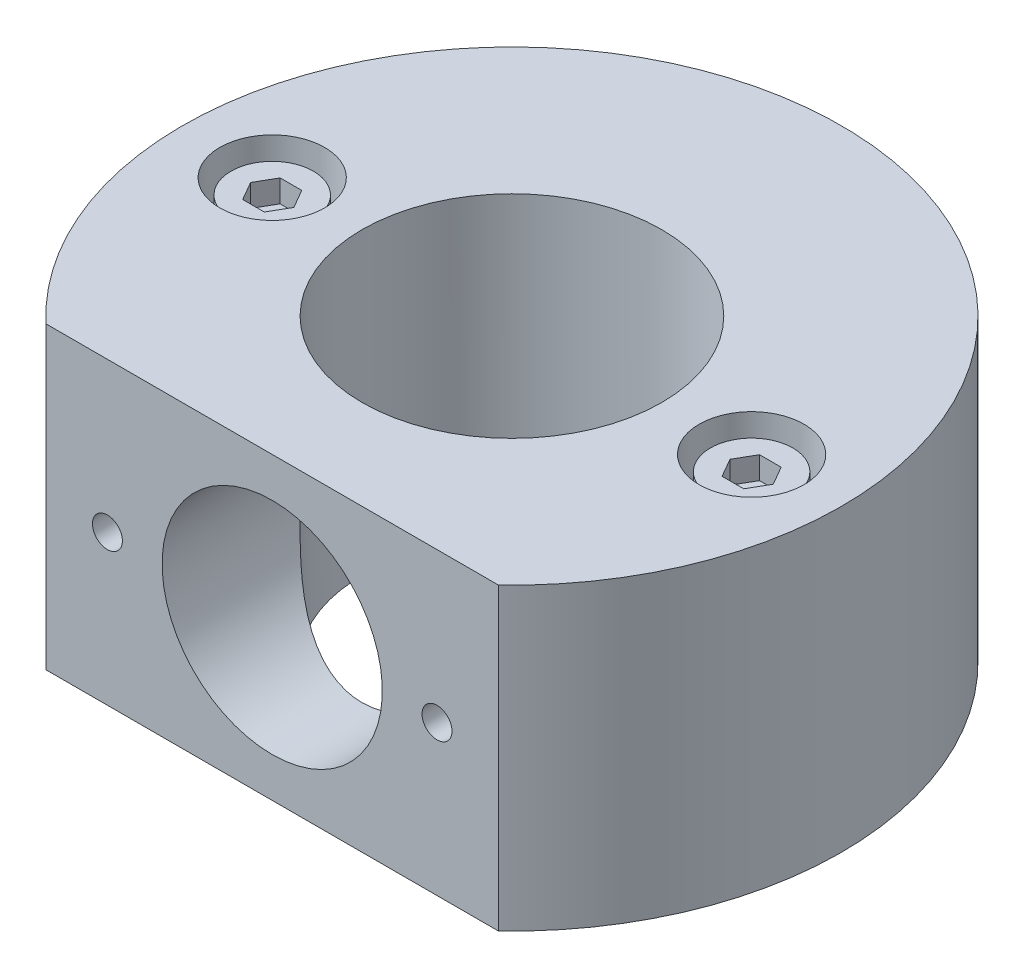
ISO-10303-21;
HEADER;
FILE_DESCRIPTION(('STEP AP214'),'2;1');
FILE_NAME('part.step','',(''),(''),'','','');
FILE_SCHEMA(('AUTOMOTIVE_DESIGN { 1 0 10303 214 1 1 1 1 }'));
ENDSEC;
DATA;
#1=APPLICATION_CONTEXT('core data for automotive mechanical design processes');
#2=APPLICATION_PROTOCOL_DEFINITION('international standard','automotive_design',2000,#1);
#3=PRODUCT_CONTEXT('',#1,'mechanical');
#4=PRODUCT('Part','Part','',(#3));
#5=PRODUCT_RELATED_PRODUCT_CATEGORY('part','',(#4));
#6=PRODUCT_DEFINITION_FORMATION('','',#4);
#7=PRODUCT_DEFINITION_CONTEXT('part definition',#1,'design');
#8=PRODUCT_DEFINITION('design','',#6,#7);
#9=PRODUCT_DEFINITION_SHAPE('','',#8);
#10=(LENGTH_UNIT() NAMED_UNIT(*) SI_UNIT(.MILLI.,.METRE.));
#11=(NAMED_UNIT(*) PLANE_ANGLE_UNIT() SI_UNIT($,.RADIAN.));
#12=(NAMED_UNIT(*) SI_UNIT($,.STERADIAN.) SOLID_ANGLE_UNIT());
#13=UNCERTAINTY_MEASURE_WITH_UNIT(LENGTH_MEASURE(1.E-05),#10,'distance_accuracy_value','');
#14=(GEOMETRIC_REPRESENTATION_CONTEXT(3) GLOBAL_UNCERTAINTY_ASSIGNED_CONTEXT((#13)) GLOBAL_UNIT_ASSIGNED_CONTEXT((#10,
#11,#12)) REPRESENTATION_CONTEXT('',''));
#15=CARTESIAN_POINT('',(0.,0.,0.));
#16=DIRECTION('',(0.,0.,1.));
#17=DIRECTION('',(1.,0.,0.));
#18=AXIS2_PLACEMENT_3D('',#15,#16,#17);
#19=CARTESIAN_POINT('',(-1.39659253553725E-13,20.,0.));
#20=DIRECTION('',(0.,-1.,0.));
#21=DIRECTION('',(1.,0.,0.));
#22=AXIS2_PLACEMENT_3D('',#19,#20,#21);
#23=CYLINDRICAL_SURFACE('',#22,10.);
#24=CARTESIAN_POINT('',(0.,0.,0.));
#25=DIRECTION('',(0.,-1.,0.));
#26=DIRECTION('',(1.,0.,0.));
#27=AXIS2_PLACEMENT_3D('',#24,#25,#26);
#28=CIRCLE('',#27,10.);
#29=CARTESIAN_POINT('',(10.,0.,0.));
#30=VERTEX_POINT('',#29);
#31=EDGE_CURVE('E269',#30,#30,#28,.T.);
#32=ORIENTED_EDGE('',*,*,#31,.T.);
#33=EDGE_LOOP('',(#32));
#34=FACE_BOUND('',#33,.T.);
#35=CARTESIAN_POINT('',(0.,2.65000000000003,10.));
#36=CARTESIAN_POINT('',(0.180390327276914,2.65000174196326,9.99999832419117));
#37=CARTESIAN_POINT('',(0.360822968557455,2.65665281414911,9.99510702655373));
#38=CARTESIAN_POINT('',(0.720269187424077,2.6831548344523,9.97565259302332));
#39=CARTESIAN_POINT('',(0.899281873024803,2.70301350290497,9.96108380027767));
#40=CARTESIAN_POINT('',(1.2547195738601,2.75565650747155,9.92258482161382));
#41=CARTESIAN_POINT('',(1.4311390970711,2.78846505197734,9.89863710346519));
#42=CARTESIAN_POINT('',(1.77982659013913,2.86651144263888,9.84192264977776));
#43=CARTESIAN_POINT('',(1.95209268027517,2.91175480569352,9.80915199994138));
#44=CARTESIAN_POINT('',(2.29020515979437,3.01369687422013,9.73574273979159));
#45=CARTESIAN_POINT('',(2.45608584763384,3.0703196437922,9.69515635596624));
#46=CARTESIAN_POINT('',(2.78175016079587,3.19450383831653,9.60678846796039));
#47=CARTESIAN_POINT('',(2.94153134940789,3.26206957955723,9.55900412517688));
#48=CARTESIAN_POINT('',(3.41036458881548,3.47999351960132,9.40623074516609));
#49=CARTESIAN_POINT('',(3.70934416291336,3.64571288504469,9.29172279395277));
#50=CARTESIAN_POINT('',(4.30219236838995,4.02926023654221,9.03356372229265));
#51=CARTESIAN_POINT('',(4.59308875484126,4.25046924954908,8.88820449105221));
#52=CARTESIAN_POINT('',(5.13632863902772,4.73007352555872,8.58573144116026));
#53=CARTESIAN_POINT('',(5.38861062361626,4.98852687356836,8.42859944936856));
#54=CARTESIAN_POINT('',(5.75909662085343,5.4281764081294,8.17685733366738));
#55=CARTESIAN_POINT('',(5.89043001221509,5.59866252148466,8.08250675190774));
#56=CARTESIAN_POINT('',(6.13821836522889,5.95138965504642,7.89596683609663));
#57=CARTESIAN_POINT('',(6.25466900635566,6.13363406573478,7.80377813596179));
#58=CARTESIAN_POINT('',(6.47188173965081,6.50940282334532,7.62460175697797));
#59=CARTESIAN_POINT('',(6.57266103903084,6.70291447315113,7.53760843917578));
#60=CARTESIAN_POINT('',(6.75770112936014,7.10100253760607,7.37216836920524));
#61=CARTESIAN_POINT('',(6.8419711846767,7.30557266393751,7.29371683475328));
#62=CARTESIAN_POINT('',(7.0177544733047,7.79510934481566,7.12534065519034));
#63=CARTESIAN_POINT('',(7.10247396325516,8.08432114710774,7.04017907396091));
#64=CARTESIAN_POINT('',(7.2029759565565,8.5293565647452,6.93681746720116));
#65=CARTESIAN_POINT('',(7.23203843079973,8.67948608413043,6.90643703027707));
#66=CARTESIAN_POINT('',(7.28088735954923,8.98278316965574,6.85492136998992));
#67=CARTESIAN_POINT('',(7.3006784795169,9.13594916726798,6.83378149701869));
#68=CARTESIAN_POINT('',(7.33072262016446,9.44556447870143,6.80154402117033));
#69=CARTESIAN_POINT('',(7.34089546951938,9.60203046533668,6.79053084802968));
#70=CARTESIAN_POINT('',(7.35119075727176,9.91568092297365,6.77938449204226));
#71=CARTESIAN_POINT('',(7.3513136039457,10.0728653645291,6.77925086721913));
#72=CARTESIAN_POINT('',(7.3415029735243,10.3866354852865,6.78987368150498));
#73=CARTESIAN_POINT('',(7.331563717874,10.5432207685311,6.80063637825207));
#74=CARTESIAN_POINT('',(7.30184674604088,10.8543836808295,6.83253266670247));
#75=CARTESIAN_POINT('',(7.28206794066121,11.0089610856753,6.85366740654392));
#76=CARTESIAN_POINT('',(7.23046493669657,11.3312655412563,6.90810585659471));
#77=CARTESIAN_POINT('',(7.1975839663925,11.4986441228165,6.94246415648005));
#78=CARTESIAN_POINT('',(7.12091997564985,11.8285836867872,7.02107568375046));
#79=CARTESIAN_POINT('',(7.07712966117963,11.9911413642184,7.06533552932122));
#80=CARTESIAN_POINT('',(6.97925499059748,12.3109570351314,7.16203423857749));
#81=CARTESIAN_POINT('',(6.92515136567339,12.4682044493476,7.21448837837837));
#82=CARTESIAN_POINT('',(6.80734755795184,12.7766476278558,7.32574797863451));
#83=CARTESIAN_POINT('',(6.74364995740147,12.9278450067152,7.38455172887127));
#84=CARTESIAN_POINT('',(6.5830233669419,13.2764362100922,7.52855713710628));
#85=CARTESIAN_POINT('',(6.48230595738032,13.4712712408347,7.61574338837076));
#86=CARTESIAN_POINT('',(6.26514005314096,13.8494268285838,7.79537663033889));
#87=CARTESIAN_POINT('',(6.14868639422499,14.0327435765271,7.88782534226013));
#88=CARTESIAN_POINT('',(5.9005774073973,14.3877814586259,8.07510803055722));
#89=CARTESIAN_POINT('',(5.76890779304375,14.5594914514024,8.16994418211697));
#90=CARTESIAN_POINT('',(5.49090211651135,14.8907297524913,8.35932321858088));
#91=CARTESIAN_POINT('',(5.34456774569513,15.0502594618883,8.45386613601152));
#92=CARTESIAN_POINT('',(5.03530313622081,15.3587890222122,8.641697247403));
#93=CARTESIAN_POINT('',(4.87216175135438,15.5076010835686,8.73494695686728));
#94=CARTESIAN_POINT('',(4.5314452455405,15.7911676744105,8.91646022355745));
#95=CARTESIAN_POINT('',(4.35386857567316,15.9259206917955,9.00472324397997));
#96=CARTESIAN_POINT('',(3.98517305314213,16.179878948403,9.17384614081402));
#97=CARTESIAN_POINT('',(3.79408117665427,16.2991138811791,9.25472006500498));
#98=CARTESIAN_POINT('',(3.39888660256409,16.5208398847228,9.40703801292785));
#99=CARTESIAN_POINT('',(3.19478881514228,16.6233372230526,9.47848556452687));
#100=CARTESIAN_POINT('',(2.82857918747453,16.7860804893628,9.59301645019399));
#101=CARTESIAN_POINT('',(2.66908362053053,16.8504273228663,9.63868009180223));
#102=CARTESIAN_POINT('',(2.34429211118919,16.9682579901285,9.72277811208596));
#103=CARTESIAN_POINT('',(2.17899746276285,17.0217442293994,9.76121409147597));
#104=CARTESIAN_POINT('',(1.84356633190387,17.117173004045,9.83008450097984));
#105=CARTESIAN_POINT('',(1.67343241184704,17.1591215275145,9.86052308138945));
#106=CARTESIAN_POINT('',(1.3293139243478,17.2309276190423,9.91277999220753));
#107=CARTESIAN_POINT('',(1.15532925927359,17.2607848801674,9.93459810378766));
#108=CARTESIAN_POINT('',(0.804059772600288,17.3080446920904,9.9691903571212));
#109=CARTESIAN_POINT('',(0.626764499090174,17.3253967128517,9.98192780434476));
#110=CARTESIAN_POINT('',(0.270951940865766,17.3471662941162,9.99791466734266));
#111=CARTESIAN_POINT('',(0.0924346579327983,17.3515838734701,10.0011640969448));
#112=CARTESIAN_POINT('',(-0.264365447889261,17.3474106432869,9.99809688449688));
#113=CARTESIAN_POINT('',(-0.442648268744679,17.3388197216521,9.99178016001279));
#114=CARTESIAN_POINT('',(-0.797530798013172,17.3087724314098,9.96973170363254));
#115=CARTESIAN_POINT('',(-0.974130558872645,17.2873164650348,9.9540002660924));
#116=CARTESIAN_POINT('',(-1.3134055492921,17.2336097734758,9.91475151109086));
#117=CARTESIAN_POINT('',(-1.47626433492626,17.2021123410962,9.89177850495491));
#118=CARTESIAN_POINT('',(-1.79836129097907,17.1285131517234,9.8383210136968));
#119=CARTESIAN_POINT('',(-1.95759821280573,17.0864077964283,9.80783397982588));
#120=CARTESIAN_POINT('',(-2.2714917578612,16.9921147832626,9.73992287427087));
#121=CARTESIAN_POINT('',(-2.42614951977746,16.9399296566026,9.70250054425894));
#122=CARTESIAN_POINT('',(-2.73023946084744,16.8260302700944,9.62136171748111));
#123=CARTESIAN_POINT('',(-2.87966969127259,16.7643125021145,9.57764290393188));
#124=CARTESIAN_POINT('',(-3.34206567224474,16.5553865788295,9.43081133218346));
#125=CARTESIAN_POINT('',(-3.64455442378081,16.3917753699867,9.31742441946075));
#126=CARTESIAN_POINT('',(-4.21855637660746,16.0284294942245,9.07201518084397));
#127=CARTESIAN_POINT('',(-4.49005069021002,15.8286729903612,8.93998160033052));
#128=CARTESIAN_POINT('',(-4.895962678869,15.4855358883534,8.7211808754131));
#129=CARTESIAN_POINT('',(-5.0411200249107,15.3523980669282,8.63791910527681));
#130=CARTESIAN_POINT('',(-5.31967582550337,15.075636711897,8.46921126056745));
#131=CARTESIAN_POINT('',(-5.45307624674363,14.9320149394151,8.38376555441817));
#132=CARTESIAN_POINT('',(-5.70800971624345,14.6346020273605,8.21232314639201));
#133=CARTESIAN_POINT('',(-5.82952974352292,14.4808000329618,8.1263259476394));
#134=CARTESIAN_POINT('',(-6.0602360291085,14.1634737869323,7.95575942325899));
#135=CARTESIAN_POINT('',(-6.16942369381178,13.9999506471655,7.87118993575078));
#136=CARTESIAN_POINT('',(-6.3652226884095,13.6794370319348,7.71350762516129));
#137=CARTESIAN_POINT('',(-6.45299424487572,13.5233141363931,7.64007200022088));
#138=CARTESIAN_POINT('',(-6.61766375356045,13.203341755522,7.49789019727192));
#139=CARTESIAN_POINT('',(-6.69456114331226,13.0394918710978,7.42914426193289));
#140=CARTESIAN_POINT('',(-6.83674770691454,12.7045207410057,7.29850595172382));
#141=CARTESIAN_POINT('',(-6.90205555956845,12.5334117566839,7.23660261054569));
#142=CARTESIAN_POINT('',(-7.02041577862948,12.1840867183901,7.12183713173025));
#143=CARTESIAN_POINT('',(-7.07347336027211,12.0058737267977,7.06897114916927));
#144=CARTESIAN_POINT('',(-7.15556750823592,11.6855094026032,6.98573034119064));
#145=CARTESIAN_POINT('',(-7.18731995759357,11.5446668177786,6.95298679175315));
#146=CARTESIAN_POINT('',(-7.24266770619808,11.2598752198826,6.8953147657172));
#147=CARTESIAN_POINT('',(-7.26626780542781,11.1159280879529,6.87038169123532));
#148=CARTESIAN_POINT('',(-7.30492518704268,10.8258069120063,6.82926555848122));
#149=CARTESIAN_POINT('',(-7.31999195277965,10.6796355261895,6.81307278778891));
#150=CARTESIAN_POINT('',(-7.34133875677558,10.3859074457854,6.79006588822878));
#151=CARTESIAN_POINT('',(-7.34761878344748,10.2383507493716,6.78325177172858));
#152=CARTESIAN_POINT('',(-7.35126719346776,9.94262210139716,6.77929780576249));
#153=CARTESIAN_POINT('',(-7.34861300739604,9.79444953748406,6.78218245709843));
#154=CARTESIAN_POINT('',(-7.33439913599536,9.4990418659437,6.79755076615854));
#155=CARTESIAN_POINT('',(-7.32283950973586,9.3518067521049,6.81003436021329));
#156=CARTESIAN_POINT('',(-7.29102871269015,9.05921382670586,6.84408060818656));
#157=CARTESIAN_POINT('',(-7.27076954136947,8.91385787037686,6.86565161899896));
#158=CARTESIAN_POINT('',(-7.22190304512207,8.62597113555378,6.91703466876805));
#159=CARTESIAN_POINT('',(-7.19329074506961,8.48344209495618,6.94685161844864));
#160=CARTESIAN_POINT('',(-7.11897553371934,8.16235446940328,7.02308773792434));
#161=CARTESIAN_POINT('',(-7.07072929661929,7.98493106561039,7.07181773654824));
#162=CARTESIAN_POINT('',(-6.96210762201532,7.63677154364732,7.17877832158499));
#163=CARTESIAN_POINT('',(-6.9017269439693,7.46603835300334,7.23701301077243));
#164=CARTESIAN_POINT('',(-6.76949774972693,7.13140525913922,7.36085037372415));
#165=CARTESIAN_POINT('',(-6.69762512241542,6.9675206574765,7.4264684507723));
#166=CARTESIAN_POINT('',(-6.54314764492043,6.64718870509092,7.56292568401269));
#167=CARTESIAN_POINT('',(-6.46054254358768,6.49074152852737,7.63376496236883));
#168=CARTESIAN_POINT('',(-6.26066653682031,6.14289967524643,7.79905180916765));
#169=CARTESIAN_POINT('',(-6.14014337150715,5.95388406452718,7.89458664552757));
#170=CARTESIAN_POINT('',(-5.88301972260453,5.58836509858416,8.08801480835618));
#171=CARTESIAN_POINT('',(-5.74641474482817,5.41186526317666,8.18590878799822));
#172=CARTESIAN_POINT('',(-5.45768387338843,5.07192886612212,8.38117225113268));
#173=CARTESIAN_POINT('',(-5.3055664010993,4.90848530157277,8.47854198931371));
#174=CARTESIAN_POINT('',(-4.9861363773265,4.59528423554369,8.67024379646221));
#175=CARTESIAN_POINT('',(-4.81882764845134,4.44552330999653,8.76457662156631));
#176=CARTESIAN_POINT('',(-4.49653039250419,4.18278683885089,8.933588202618));
#177=CARTESIAN_POINT('',(-4.3436600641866,4.06770957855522,9.00904499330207));
#178=CARTESIAN_POINT('',(-4.02769008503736,3.84881009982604,9.15466874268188));
#179=CARTESIAN_POINT('',(-3.86459211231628,3.74498604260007,9.22483656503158));
#180=CARTESIAN_POINT('',(-3.52875680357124,3.54956662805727,9.35844602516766));
#181=CARTESIAN_POINT('',(-3.35602633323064,3.45796271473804,9.42189236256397));
#182=CARTESIAN_POINT('',(-3.00154534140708,3.28793292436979,9.54073621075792));
#183=CARTESIAN_POINT('',(-2.81979653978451,3.20950454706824,9.5961352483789));
#184=CARTESIAN_POINT('',(-2.47646539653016,3.07770879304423,9.68988193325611));
#185=CARTESIAN_POINT('',(-2.31600575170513,3.02234454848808,9.72954138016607));
#186=CARTESIAN_POINT('',(-1.99011495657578,2.92250250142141,9.80139112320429));
#187=CARTESIAN_POINT('',(-1.82468472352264,2.878022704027,9.83358278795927));
#188=CARTESIAN_POINT('',(-1.49015642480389,2.80060067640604,9.88979999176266));
#189=CARTESIAN_POINT('',(-1.32106679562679,2.76763440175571,9.91384254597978));
#190=CARTESIAN_POINT('',(-0.980070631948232,2.71359269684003,9.95333557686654));
#191=CARTESIAN_POINT('',(-0.808165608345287,2.69251109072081,9.96879051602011));
#192=CARTESIAN_POINT('',(-0.529971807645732,2.66836597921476,9.98650701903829));
#193=CARTESIAN_POINT('',(-0.424171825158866,2.66148350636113,9.99156216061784));
#194=CARTESIAN_POINT('',(-0.212252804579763,2.65229970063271,9.99830936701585));
#195=CARTESIAN_POINT('',(-0.106133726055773,2.64999897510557,10.0000009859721));
#196=CARTESIAN_POINT('',(0.,2.65000000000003,10.));
#197=B_SPLINE_CURVE_WITH_KNOTS('',3,(#35,#36,#37,#38,#39,#40,#41,#42,#43,#44,#45,#46,#47,#48,
#49,#50,#51,#52,#53,#54,#55,#56,#57,#58,#59,#60,#61,#62,#63,#64,#65,#66,#67,#68,#69,#70,#71,#72,
#73,#74,#75,#76,#77,#78,#79,#80,#81,#82,#83,#84,#85,#86,#87,#88,#89,#90,#91,#92,#93,#94,#95,#96,
#97,#98,#99,#100,#101,#102,#103,#104,#105,#106,#107,#108,#109,#110,#111,#112,#113,#114,#115,
#116,#117,#118,#119,#120,#121,#122,#123,#124,#125,#126,#127,#128,#129,#130,#131,#132,#133,#134,
#135,#136,#137,#138,#139,#140,#141,#142,#143,#144,#145,#146,#147,#148,#149,#150,#151,#152,#153,
#154,#155,#156,#157,#158,#159,#160,#161,#162,#163,#164,#165,#166,#167,#168,#169,#170,#171,#172,
#173,#174,#175,#176,#177,#178,#179,#180,#181,#182,#183,#184,#185,#186,#187,#188,#189,#190,#191,
#192,#193,#194,#195,#196),.UNSPECIFIED.,.T.,.F.,(4,2,2,2,2,2,2,2,2,2,2,2,2,2,2,2,2,2,2,2,2,2,2,
2,2,2,2,2,2,2,2,2,2,2,2,2,2,2,2,2,2,2,2,2,2,2,2,2,2,2,2,2,2,2,2,2,2,2,2,2,2,2,2,2,2,2,2,2,2,2,2,
2,2,2,2,2,2,2,2,2,4),(0.,0.541057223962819,1.08243099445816,1.6248216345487,2.16745330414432,
2.70657748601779,3.24591483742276,4.32319944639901,5.499081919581,6.6768185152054,
7.38110177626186,8.08558903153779,8.78929720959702,9.49260935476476,10.4281160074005,
10.8953581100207,11.3623648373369,11.8332307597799,12.3040775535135,12.7751949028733,
13.2463644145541,13.7676096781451,14.2892043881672,14.8117833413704,15.3342218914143,
16.0413017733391,16.7486142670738,17.4565963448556,18.164496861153,18.8827349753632,
19.6010502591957,20.3179701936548,21.034621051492,21.5679363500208,22.1011333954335,
22.6340531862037,23.1669865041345,23.7020613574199,24.2371354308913,24.7722141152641,
25.3072760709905,25.8091029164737,26.3111002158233,26.812971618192,27.3150281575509,
28.3970065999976,29.4796409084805,30.1206428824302,30.7615374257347,31.4031266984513,
32.0446427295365,32.6248919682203,33.2051712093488,33.7845065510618,34.3635947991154,
34.8073117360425,35.2507669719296,35.6937284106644,36.1366904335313,36.5807722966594,
37.0248512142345,37.4693394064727,37.9140928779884,38.4838750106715,39.0539037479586,
39.6251445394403,40.1963987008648,40.9265011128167,41.6568080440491,42.386720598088,
43.1164499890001,43.7329194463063,44.3492880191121,44.9652227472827,45.5810404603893,
46.1034494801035,46.6257626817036,47.1469784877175,47.6679231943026,47.9862152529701,
48.3045495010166),.UNSPECIFIED.);
#198=CARTESIAN_POINT('',(0.,2.65000000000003,10.));
#199=VERTEX_POINT('',#198);
#200=EDGE_CURVE('E19',#199,#199,#197,.T.);
#201=ORIENTED_EDGE('',*,*,#200,.T.);
#202=EDGE_LOOP('',(#201));
#203=FACE_BOUND('',#202,.T.);
#204=CARTESIAN_POINT('',(-1.39659253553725E-13,20.,0.));
#205=DIRECTION('',(0.,1.,0.));
#206=DIRECTION('',(-1.,0.,0.));
#207=AXIS2_PLACEMENT_3D('',#204,#205,#206);
#208=CIRCLE('',#207,10.);
#209=CARTESIAN_POINT('',(-10.0000000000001,19.9999999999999,0.));
#210=VERTEX_POINT('',#209);
#211=EDGE_CURVE('E283',#210,#210,#208,.T.);
#212=ORIENTED_EDGE('',*,*,#211,.T.);
#213=EDGE_LOOP('',(#212));
#214=FACE_BOUND('',#213,.T.);
#215=ADVANCED_FACE('F15',(#34,#203,#214),#23,.F.);
#216=CARTESIAN_POINT('',(-1.39659253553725E-13,20.,0.));
#217=DIRECTION('',(0.,1.,0.));
#218=DIRECTION('',(-1.,0.,0.));
#219=AXIS2_PLACEMENT_3D('',#216,#217,#218);
#220=PLANE('',#219);
#221=DIRECTION('',(-1.,0.,0.));
#222=VECTOR('',#221,1.);
#223=CARTESIAN_POINT('',(-1.39659253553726E-13,20.,16.));
#224=LINE('',#223,#222);
#225=CARTESIAN_POINT('',(15.0996688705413,20.,16.));
#226=VERTEX_POINT('',#225);
#227=CARTESIAN_POINT('',(-15.0996688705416,20.,16.));
#228=VERTEX_POINT('',#227);
#229=EDGE_CURVE('E289',#226,#228,#224,.T.);
#230=ORIENTED_EDGE('',*,*,#229,.F.);
#231=CARTESIAN_POINT('',(-1.39659253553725E-13,20.,0.));
#232=DIRECTION('',(0.,1.,0.));
#233=DIRECTION('',(-1.,0.,0.));
#234=AXIS2_PLACEMENT_3D('',#231,#232,#233);
#235=CIRCLE('',#234,22.);
#236=EDGE_CURVE('E291',#226,#228,#235,.T.);
#237=ORIENTED_EDGE('',*,*,#236,.T.);
#238=EDGE_LOOP('',(#230,#237));
#239=FACE_BOUND('',#238,.T.);
#240=CARTESIAN_POINT('',(16.,20.,0.));
#241=DIRECTION('',(0.,1.,0.));
#242=DIRECTION('',(-1.,0.,0.));
#243=AXIS2_PLACEMENT_3D('',#240,#241,#242);
#244=CIRCLE('',#243,3.5);
#245=CARTESIAN_POINT('',(12.5,20.,0.));
#246=VERTEX_POINT('',#245);
#247=EDGE_CURVE('E286',#246,#246,#244,.T.);
#248=ORIENTED_EDGE('',*,*,#247,.F.);
#249=EDGE_LOOP('',(#248));
#250=FACE_BOUND('',#249,.T.);
#251=ORIENTED_EDGE('',*,*,#211,.F.);
#252=EDGE_LOOP('',(#251));
#253=FACE_BOUND('',#252,.T.);
#254=CARTESIAN_POINT('',(-16.,20.,0.));
#255=DIRECTION('',(0.,1.,0.));
#256=DIRECTION('',(-1.,0.,0.));
#257=AXIS2_PLACEMENT_3D('',#254,#255,#256);
#258=CIRCLE('',#257,3.5);
#259=CARTESIAN_POINT('',(-19.5,20.,0.));
#260=VERTEX_POINT('',#259);
#261=EDGE_CURVE('E280',#260,#260,#258,.T.);
#262=ORIENTED_EDGE('',*,*,#261,.F.);
#263=EDGE_LOOP('',(#262));
#264=FACE_BOUND('',#263,.T.);
#265=ADVANCED_FACE('F322',(#239,#250,#253,#264),#220,.T.);
#266=CARTESIAN_POINT('',(0.,0.,0.));
#267=DIRECTION('',(0.,1.,0.));
#268=DIRECTION('',(-1.,0.,0.));
#269=AXIS2_PLACEMENT_3D('',#266,#267,#268);
#270=PLANE('',#269);
#271=DIRECTION('',(1.,0.,0.));
#272=VECTOR('',#271,1.);
#273=CARTESIAN_POINT('',(0.,0.,16.));
#274=LINE('',#273,#272);
#275=CARTESIAN_POINT('',(-15.0996688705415,0.,16.));
#276=VERTEX_POINT('',#275);
#277=CARTESIAN_POINT('',(15.0996688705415,1.61304125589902E-13,16.));
#278=VERTEX_POINT('',#277);
#279=EDGE_CURVE('E275',#276,#278,#274,.T.);
#280=ORIENTED_EDGE('',*,*,#279,.F.);
#281=CARTESIAN_POINT('',(0.,0.,0.));
#282=DIRECTION('',(0.,-1.,0.));
#283=DIRECTION('',(1.,0.,0.));
#284=AXIS2_PLACEMENT_3D('',#281,#282,#283);
#285=CIRCLE('',#284,22.);
#286=EDGE_CURVE('E277',#276,#278,#285,.T.);
#287=ORIENTED_EDGE('',*,*,#286,.T.);
#288=EDGE_LOOP('',(#280,#287));
#289=FACE_BOUND('',#288,.T.);
#290=CARTESIAN_POINT('',(16.,1.1172740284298E-13,0.));
#291=DIRECTION('',(0.,-1.,0.));
#292=DIRECTION('',(1.,0.,0.));
#293=AXIS2_PLACEMENT_3D('',#290,#291,#292);
#294=CIRCLE('',#293,1.75);
#295=CARTESIAN_POINT('',(17.75,1.23947587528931E-13,0.));
#296=VERTEX_POINT('',#295);
#297=EDGE_CURVE('E272',#296,#296,#294,.T.);
#298=ORIENTED_EDGE('',*,*,#297,.F.);
#299=EDGE_LOOP('',(#298));
#300=FACE_BOUND('',#299,.T.);
#301=ORIENTED_EDGE('',*,*,#31,.F.);
#302=EDGE_LOOP('',(#301));
#303=FACE_BOUND('',#302,.T.);
#304=CARTESIAN_POINT('',(-16.,-1.1172740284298E-13,0.));
#305=DIRECTION('',(0.,-1.,0.));
#306=DIRECTION('',(1.,0.,0.));
#307=AXIS2_PLACEMENT_3D('',#304,#305,#306);
#308=CIRCLE('',#307,1.75);
#309=CARTESIAN_POINT('',(-14.25,0.,0.));
#310=VERTEX_POINT('',#309);
#311=EDGE_CURVE('E266',#310,#310,#308,.T.);
#312=ORIENTED_EDGE('',*,*,#311,.F.);
#313=EDGE_LOOP('',(#312));
#314=FACE_BOUND('',#313,.T.);
#315=ADVANCED_FACE('F328',(#289,#300,#303,#314),#270,.F.);
#316=CARTESIAN_POINT('',(-1.39659253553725E-13,20.,0.));
#317=DIRECTION('',(0.,-1.,0.));
#318=DIRECTION('',(1.,0.,0.));
#319=AXIS2_PLACEMENT_3D('',#316,#317,#318);
#320=CYLINDRICAL_SURFACE('',#319,22.);
#321=ORIENTED_EDGE('',*,*,#286,.F.);
#322=DIRECTION('',(0.,-1.,0.));
#323=VECTOR('',#322,1.);
#324=CARTESIAN_POINT('',(-15.0996688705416,20.,16.));
#325=LINE('',#324,#323);
#326=EDGE_CURVE('E10',#228,#276,#325,.T.);
#327=ORIENTED_EDGE('',*,*,#326,.F.);
#328=ORIENTED_EDGE('',*,*,#236,.F.);
#329=DIRECTION('',(0.,-1.,0.));
#330=VECTOR('',#329,1.);
#331=CARTESIAN_POINT('',(15.0996688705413,20.,16.));
#332=LINE('',#331,#330);
#333=EDGE_CURVE('E29',#226,#278,#332,.T.);
#334=ORIENTED_EDGE('',*,*,#333,.T.);
#335=EDGE_LOOP('',(#321,#327,#328,#334));
#336=FACE_BOUND('',#335,.T.);
#337=ADVANCED_FACE('F17',(#336),#320,.T.);
#338=CARTESIAN_POINT('',(15.0996688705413,20.,16.));
#339=DIRECTION('',(0.,0.,-1.));
#340=DIRECTION('',(0.,-1.,0.));
#341=AXIS2_PLACEMENT_3D('',#338,#339,#340);
#342=PLANE('',#341);
#343=CARTESIAN_POINT('',(-11.,10.,16.));
#344=DIRECTION('',(0.,0.,1.));
#345=DIRECTION('',(0.,1.,0.));
#346=AXIS2_PLACEMENT_3D('',#343,#344,#345);
#347=CIRCLE('',#346,1.);
#348=CARTESIAN_POINT('',(-11.,11.,16.));
#349=VERTEX_POINT('',#348);
#350=EDGE_CURVE('E251',#349,#349,#347,.T.);
#351=ORIENTED_EDGE('',*,*,#350,.F.);
#352=EDGE_LOOP('',(#351));
#353=FACE_BOUND('',#352,.T.);
#354=CARTESIAN_POINT('',(11.,10.0000000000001,16.));
#355=DIRECTION('',(0.,0.,1.));
#356=DIRECTION('',(0.,1.,0.));
#357=AXIS2_PLACEMENT_3D('',#354,#355,#356);
#358=CIRCLE('',#357,1.);
#359=CARTESIAN_POINT('',(11.,11.0000000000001,16.));
#360=VERTEX_POINT('',#359);
#361=EDGE_CURVE('E255',#360,#360,#358,.T.);
#362=ORIENTED_EDGE('',*,*,#361,.F.);
#363=EDGE_LOOP('',(#362));
#364=FACE_BOUND('',#363,.T.);
#365=ORIENTED_EDGE('',*,*,#279,.T.);
#366=ORIENTED_EDGE('',*,*,#333,.F.);
#367=ORIENTED_EDGE('',*,*,#229,.T.);
#368=ORIENTED_EDGE('',*,*,#326,.T.);
#369=EDGE_LOOP('',(#365,#366,#367,#368));
#370=FACE_BOUND('',#369,.T.);
#371=CARTESIAN_POINT('',(0.,10.,16.));
#372=DIRECTION('',(0.,0.,1.));
#373=DIRECTION('',(0.,1.,0.));
#374=AXIS2_PLACEMENT_3D('',#371,#372,#373);
#375=CIRCLE('',#374,7.35);
#376=CARTESIAN_POINT('',(-1.21154402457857E-13,17.35,16.));
#377=VERTEX_POINT('',#376);
#378=EDGE_CURVE('E261',#377,#377,#375,.T.);
#379=ORIENTED_EDGE('',*,*,#378,.F.);
#380=EDGE_LOOP('',(#379));
#381=FACE_BOUND('',#380,.T.);
#382=ADVANCED_FACE('F308',(#353,#364,#370,#381),#342,.F.);
#383=CARTESIAN_POINT('',(0.,10.,16.));
#384=DIRECTION('',(0.,0.,-1.));
#385=DIRECTION('',(0.,-1.,0.));
#386=AXIS2_PLACEMENT_3D('',#383,#384,#385);
#387=CYLINDRICAL_SURFACE('',#386,7.35);
#388=ORIENTED_EDGE('',*,*,#378,.T.);
#389=EDGE_LOOP('',(#388));
#390=FACE_BOUND('',#389,.T.);
#391=ORIENTED_EDGE('',*,*,#200,.F.);
#392=EDGE_LOOP('',(#391));
#393=FACE_BOUND('',#392,.T.);
#394=ADVANCED_FACE('F305',(#390,#393),#387,.F.);
#395=CARTESIAN_POINT('',(16.,20.,0.));
#396=DIRECTION('',(0.,1.,0.));
#397=DIRECTION('',(-1.,0.,0.));
#398=AXIS2_PLACEMENT_3D('',#395,#396,#397);
#399=CYLINDRICAL_SURFACE('',#398,1.75);
#400=CARTESIAN_POINT('',(16.,16.,0.));
#401=DIRECTION('',(0.,-1.,0.));
#402=DIRECTION('',(1.,0.,0.));
#403=AXIS2_PLACEMENT_3D('',#400,#401,#402);
#404=CIRCLE('',#403,1.75);
#405=CARTESIAN_POINT('',(17.75,16.,0.));
#406=VERTEX_POINT('',#405);
#407=EDGE_CURVE('E184',#406,#406,#404,.F.);
#408=ORIENTED_EDGE('',*,*,#407,.T.);
#409=EDGE_LOOP('',(#408));
#410=FACE_BOUND('',#409,.T.);
#411=ORIENTED_EDGE('',*,*,#297,.T.);
#412=EDGE_LOOP('',(#411));
#413=FACE_BOUND('',#412,.T.);
#414=ADVANCED_FACE('F307',(#410,#413),#399,.F.);
#415=CARTESIAN_POINT('',(12.5,16.,0.));
#416=DIRECTION('',(0.,-1.,0.));
#417=DIRECTION('',(1.,0.,0.));
#418=AXIS2_PLACEMENT_3D('',#415,#416,#417);
#419=PLANE('',#418);
#420=CARTESIAN_POINT('',(16.,16.,0.));
#421=DIRECTION('',(0.,1.,0.));
#422=DIRECTION('',(0.,0.,-1.));
#423=AXIS2_PLACEMENT_3D('',#420,#421,#422);
#424=CIRCLE('',#423,2.75);
#425=CARTESIAN_POINT('',(16.,16.,-2.75000000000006));
#426=VERTEX_POINT('',#425);
#427=EDGE_CURVE('E130',#426,#426,#424,.T.);
#428=ORIENTED_EDGE('',*,*,#427,.F.);
#429=EDGE_LOOP('',(#428));
#430=FACE_BOUND('',#429,.T.);
#431=CARTESIAN_POINT('',(16.,16.,0.));
#432=DIRECTION('',(0.,1.,0.));
#433=DIRECTION('',(-1.,0.,0.));
#434=AXIS2_PLACEMENT_3D('',#431,#432,#433);
#435=CIRCLE('',#434,3.5);
#436=CARTESIAN_POINT('',(12.5,16.,0.));
#437=VERTEX_POINT('',#436);
#438=EDGE_CURVE('E297',#437,#437,#435,.T.);
#439=ORIENTED_EDGE('',*,*,#438,.T.);
#440=EDGE_LOOP('',(#439));
#441=FACE_BOUND('',#440,.T.);
#442=ADVANCED_FACE('F316',(#430,#441),#419,.F.);
#443=CARTESIAN_POINT('',(16.,20.,0.));
#444=DIRECTION('',(0.,1.,0.));
#445=DIRECTION('',(-1.,0.,0.));
#446=AXIS2_PLACEMENT_3D('',#443,#444,#445);
#447=CYLINDRICAL_SURFACE('',#446,3.5);
#448=ORIENTED_EDGE('',*,*,#247,.T.);
#449=EDGE_LOOP('',(#448));
#450=FACE_BOUND('',#449,.T.);
#451=ORIENTED_EDGE('',*,*,#438,.F.);
#452=EDGE_LOOP('',(#451));
#453=FACE_BOUND('',#452,.T.);
#454=ADVANCED_FACE('F350',(#450,#453),#447,.F.);
#455=CARTESIAN_POINT('',(-16.,20.,0.));
#456=DIRECTION('',(0.,1.,0.));
#457=DIRECTION('',(-1.,0.,0.));
#458=AXIS2_PLACEMENT_3D('',#455,#456,#457);
#459=CYLINDRICAL_SURFACE('',#458,1.75);
#460=CARTESIAN_POINT('',(-16.,16.,0.));
#461=DIRECTION('',(0.,-1.,0.));
#462=DIRECTION('',(1.,0.,0.));
#463=AXIS2_PLACEMENT_3D('',#460,#461,#462);
#464=CIRCLE('',#463,1.75);
#465=CARTESIAN_POINT('',(-14.25,16.,0.));
#466=VERTEX_POINT('',#465);
#467=EDGE_CURVE('E248',#466,#466,#464,.F.);
#468=ORIENTED_EDGE('',*,*,#467,.T.);
#469=EDGE_LOOP('',(#468));
#470=FACE_BOUND('',#469,.T.);
#471=ORIENTED_EDGE('',*,*,#311,.T.);
#472=EDGE_LOOP('',(#471));
#473=FACE_BOUND('',#472,.T.);
#474=ADVANCED_FACE('F347',(#470,#473),#459,.F.);
#475=CARTESIAN_POINT('',(-19.5,16.,0.));
#476=DIRECTION('',(0.,-1.,0.));
#477=DIRECTION('',(1.,0.,0.));
#478=AXIS2_PLACEMENT_3D('',#475,#476,#477);
#479=PLANE('',#478);
#480=CARTESIAN_POINT('',(-16.,16.,0.));
#481=DIRECTION('',(0.,1.,0.));
#482=DIRECTION('',(0.,0.,-1.));
#483=AXIS2_PLACEMENT_3D('',#480,#481,#482);
#484=CIRCLE('',#483,2.75);
#485=CARTESIAN_POINT('',(-16.,16.,-2.75000000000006));
#486=VERTEX_POINT('',#485);
#487=EDGE_CURVE('E236',#486,#486,#484,.T.);
#488=ORIENTED_EDGE('',*,*,#487,.F.);
#489=EDGE_LOOP('',(#488));
#490=FACE_BOUND('',#489,.T.);
#491=CARTESIAN_POINT('',(-16.,16.,0.));
#492=DIRECTION('',(0.,1.,0.));
#493=DIRECTION('',(-1.,0.,0.));
#494=AXIS2_PLACEMENT_3D('',#491,#492,#493);
#495=CIRCLE('',#494,3.5);
#496=CARTESIAN_POINT('',(-19.5,16.,0.));
#497=VERTEX_POINT('',#496);
#498=EDGE_CURVE('E294',#497,#497,#495,.T.);
#499=ORIENTED_EDGE('',*,*,#498,.T.);
#500=EDGE_LOOP('',(#499));
#501=FACE_BOUND('',#500,.T.);
#502=ADVANCED_FACE('F349',(#490,#501),#479,.F.);
#503=CARTESIAN_POINT('',(-16.,20.,0.));
#504=DIRECTION('',(0.,1.,0.));
#505=DIRECTION('',(-1.,0.,0.));
#506=AXIS2_PLACEMENT_3D('',#503,#504,#505);
#507=CYLINDRICAL_SURFACE('',#506,3.5);
#508=ORIENTED_EDGE('',*,*,#261,.T.);
#509=EDGE_LOOP('',(#508));
#510=FACE_BOUND('',#509,.T.);
#511=ORIENTED_EDGE('',*,*,#498,.F.);
#512=EDGE_LOOP('',(#511));
#513=FACE_BOUND('',#512,.T.);
#514=ADVANCED_FACE('F358',(#510,#513),#507,.F.);
#515=CARTESIAN_POINT('',(11.,10.0000000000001,12.));
#516=DIRECTION('',(0.,0.,1.));
#517=DIRECTION('',(0.,1.,0.));
#518=AXIS2_PLACEMENT_3D('',#515,#516,#517);
#519=PLANE('',#518);
#520=CARTESIAN_POINT('',(11.,10.0000000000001,12.));
#521=DIRECTION('',(0.,0.,1.));
#522=DIRECTION('',(0.,1.,0.));
#523=AXIS2_PLACEMENT_3D('',#520,#521,#522);
#524=CIRCLE('',#523,1.);
#525=CARTESIAN_POINT('',(11.,11.0000000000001,12.));
#526=VERTEX_POINT('',#525);
#527=EDGE_CURVE('E258',#526,#526,#524,.T.);
#528=ORIENTED_EDGE('',*,*,#527,.T.);
#529=EDGE_LOOP('',(#528));
#530=FACE_BOUND('',#529,.T.);
#531=ADVANCED_FACE('F459',(#530),#519,.T.);
#532=CARTESIAN_POINT('',(11.,10.0000000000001,12.));
#533=DIRECTION('',(0.,0.,1.));
#534=DIRECTION('',(0.,1.,0.));
#535=AXIS2_PLACEMENT_3D('',#532,#533,#534);
#536=CYLINDRICAL_SURFACE('',#535,1.);
#537=ORIENTED_EDGE('',*,*,#527,.F.);
#538=EDGE_LOOP('',(#537));
#539=FACE_BOUND('',#538,.T.);
#540=ORIENTED_EDGE('',*,*,#361,.T.);
#541=EDGE_LOOP('',(#540));
#542=FACE_BOUND('',#541,.T.);
#543=ADVANCED_FACE('F454',(#539,#542),#536,.F.);
#544=CARTESIAN_POINT('',(-11.,10.,12.));
#545=DIRECTION('',(0.,0.,1.));
#546=DIRECTION('',(0.,1.,0.));
#547=AXIS2_PLACEMENT_3D('',#544,#545,#546);
#548=PLANE('',#547);
#549=CARTESIAN_POINT('',(-11.,10.,12.));
#550=DIRECTION('',(0.,0.,1.));
#551=DIRECTION('',(0.,1.,0.));
#552=AXIS2_PLACEMENT_3D('',#549,#550,#551);
#553=CIRCLE('',#552,1.);
#554=CARTESIAN_POINT('',(-11.,11.,12.));
#555=VERTEX_POINT('',#554);
#556=EDGE_CURVE('E252',#555,#555,#553,.T.);
#557=ORIENTED_EDGE('',*,*,#556,.T.);
#558=EDGE_LOOP('',(#557));
#559=FACE_BOUND('',#558,.T.);
#560=ADVANCED_FACE('F451',(#559),#548,.T.);
#561=CARTESIAN_POINT('',(-11.,10.,12.));
#562=DIRECTION('',(0.,0.,1.));
#563=DIRECTION('',(0.,1.,0.));
#564=AXIS2_PLACEMENT_3D('',#561,#562,#563);
#565=CYLINDRICAL_SURFACE('',#564,1.);
#566=ORIENTED_EDGE('',*,*,#556,.F.);
#567=EDGE_LOOP('',(#566));
#568=FACE_BOUND('',#567,.T.);
#569=ORIENTED_EDGE('',*,*,#350,.T.);
#570=EDGE_LOOP('',(#569));
#571=FACE_BOUND('',#570,.T.);
#572=ADVANCED_FACE('F440',(#568,#571),#565,.F.);
#573=CARTESIAN_POINT('',(-16.,16.,0.));
#574=DIRECTION('',(0.,1.,0.));
#575=DIRECTION('',(0.,0.,-1.));
#576=AXIS2_PLACEMENT_3D('',#573,#574,#575);
#577=CYLINDRICAL_SURFACE('',#576,2.75);
#578=ORIENTED_EDGE('',*,*,#487,.T.);
#579=EDGE_LOOP('',(#578));
#580=FACE_BOUND('',#579,.T.);
#581=CARTESIAN_POINT('',(-16.,19.,0.));
#582=DIRECTION('',(0.,1.,0.));
#583=DIRECTION('',(0.,0.,-1.));
#584=AXIS2_PLACEMENT_3D('',#581,#582,#583);
#585=CIRCLE('',#584,2.75);
#586=CARTESIAN_POINT('',(-16.,19.,-2.75000000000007));
#587=VERTEX_POINT('',#586);
#588=EDGE_CURVE('E239',#587,#587,#585,.T.);
#589=ORIENTED_EDGE('',*,*,#588,.F.);
#590=EDGE_LOOP('',(#589));
#591=FACE_BOUND('',#590,.T.);
#592=ADVANCED_FACE('F437',(#580,#591),#577,.T.);
#593=CARTESIAN_POINT('',(-16.,19.,0.));
#594=DIRECTION('',(0.,1.,0.));
#595=DIRECTION('',(0.,0.,-1.));
#596=AXIS2_PLACEMENT_3D('',#593,#594,#595);
#597=PLANE('',#596);
#598=ORIENTED_EDGE('',*,*,#588,.T.);
#599=EDGE_LOOP('',(#598));
#600=FACE_BOUND('',#599,.T.);
#601=DIRECTION('',(0.5,0.,0.86602540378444));
#602=VECTOR('',#601,1.);
#603=CARTESIAN_POINT('',(-17.4433756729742,19.,0.));
#604=LINE('',#603,#602);
#605=CARTESIAN_POINT('',(-17.4433756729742,19.,0.));
#606=VERTEX_POINT('',#605);
#607=CARTESIAN_POINT('',(-16.7216878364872,19.,1.24999999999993));
#608=VERTEX_POINT('',#607);
#609=EDGE_CURVE('E188',#606,#608,#604,.T.);
#610=ORIENTED_EDGE('',*,*,#609,.F.);
#611=DIRECTION('',(0.5,0.,-0.866025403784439));
#612=VECTOR('',#611,1.);
#613=CARTESIAN_POINT('',(-17.4433756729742,19.,0.));
#614=LINE('',#613,#612);
#615=CARTESIAN_POINT('',(-16.7216878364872,19.,-1.25000000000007));
#616=VERTEX_POINT('',#615);
#617=EDGE_CURVE('E187',#606,#616,#614,.T.);
#618=ORIENTED_EDGE('',*,*,#617,.T.);
#619=DIRECTION('',(-1.,0.,0.));
#620=VECTOR('',#619,1.);
#621=CARTESIAN_POINT('',(-15.2783121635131,19.,-1.25000000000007));
#622=LINE('',#621,#620);
#623=CARTESIAN_POINT('',(-15.2783121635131,19.,-1.25000000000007));
#624=VERTEX_POINT('',#623);
#625=EDGE_CURVE('E201',#624,#616,#622,.T.);
#626=ORIENTED_EDGE('',*,*,#625,.F.);
#627=DIRECTION('',(-0.5,0.,-0.86602540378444));
#628=VECTOR('',#627,1.);
#629=CARTESIAN_POINT('',(-14.5566243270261,19.,0.));
#630=LINE('',#629,#628);
#631=CARTESIAN_POINT('',(-14.5566243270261,19.,0.));
#632=VERTEX_POINT('',#631);
#633=EDGE_CURVE('E198',#632,#624,#630,.T.);
#634=ORIENTED_EDGE('',*,*,#633,.F.);
#635=DIRECTION('',(-0.5,0.,0.86602540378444));
#636=VECTOR('',#635,1.);
#637=CARTESIAN_POINT('',(-14.5566243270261,19.,0.));
#638=LINE('',#637,#636);
#639=CARTESIAN_POINT('',(-15.2783121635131,19.,1.24999999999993));
#640=VERTEX_POINT('',#639);
#641=EDGE_CURVE('E195',#632,#640,#638,.T.);
#642=ORIENTED_EDGE('',*,*,#641,.T.);
#643=DIRECTION('',(1.,0.,0.));
#644=VECTOR('',#643,1.);
#645=CARTESIAN_POINT('',(-16.7216878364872,19.,1.24999999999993));
#646=LINE('',#645,#644);
#647=EDGE_CURVE('E192',#608,#640,#646,.T.);
#648=ORIENTED_EDGE('',*,*,#647,.F.);
#649=EDGE_LOOP('',(#610,#618,#626,#634,#642,#648));
#650=FACE_BOUND('',#649,.T.);
#651=ADVANCED_FACE('F407',(#600,#650),#597,.T.);
#652=CARTESIAN_POINT('',(-16.7216878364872,17.5,-1.25000000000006));
#653=DIRECTION('',(0.,1.,0.));
#654=DIRECTION('',(0.,0.,-1.));
#655=AXIS2_PLACEMENT_3D('',#652,#653,#654);
#656=PLANE('',#655);
#657=DIRECTION('',(0.5,0.,-0.866025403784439));
#658=VECTOR('',#657,1.);
#659=CARTESIAN_POINT('',(-17.4433756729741,17.5,0.));
#660=LINE('',#659,#658);
#661=CARTESIAN_POINT('',(-17.4433756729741,17.5,0.));
#662=VERTEX_POINT('',#661);
#663=CARTESIAN_POINT('',(-16.7216878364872,17.5,-1.25000000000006));
#664=VERTEX_POINT('',#663);
#665=EDGE_CURVE('E191',#662,#664,#660,.T.);
#666=ORIENTED_EDGE('',*,*,#665,.F.);
#667=DIRECTION('',(0.5,0.,0.86602540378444));
#668=VECTOR('',#667,1.);
#669=CARTESIAN_POINT('',(-17.4433756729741,17.5,0.));
#670=LINE('',#669,#668);
#671=CARTESIAN_POINT('',(-16.7216878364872,17.5,1.24999999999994));
#672=VERTEX_POINT('',#671);
#673=EDGE_CURVE('E206',#662,#672,#670,.T.);
#674=ORIENTED_EDGE('',*,*,#673,.T.);
#675=DIRECTION('',(1.,0.,0.));
#676=VECTOR('',#675,1.);
#677=CARTESIAN_POINT('',(-16.7216878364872,17.5,1.24999999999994));
#678=LINE('',#677,#676);
#679=CARTESIAN_POINT('',(-15.278312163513,17.5,1.24999999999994));
#680=VERTEX_POINT('',#679);
#681=EDGE_CURVE('E210',#672,#680,#678,.T.);
#682=ORIENTED_EDGE('',*,*,#681,.T.);
#683=DIRECTION('',(-0.5,0.,0.86602540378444));
#684=VECTOR('',#683,1.);
#685=CARTESIAN_POINT('',(-14.5566243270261,17.5,0.));
#686=LINE('',#685,#684);
#687=CARTESIAN_POINT('',(-14.5566243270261,17.5,0.));
#688=VERTEX_POINT('',#687);
#689=EDGE_CURVE('E213',#688,#680,#686,.T.);
#690=ORIENTED_EDGE('',*,*,#689,.F.);
#691=DIRECTION('',(-0.5,0.,-0.86602540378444));
#692=VECTOR('',#691,1.);
#693=CARTESIAN_POINT('',(-14.5566243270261,17.5,0.));
#694=LINE('',#693,#692);
#695=CARTESIAN_POINT('',(-15.278312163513,17.5,-1.25000000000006));
#696=VERTEX_POINT('',#695);
#697=EDGE_CURVE('E216',#688,#696,#694,.T.);
#698=ORIENTED_EDGE('',*,*,#697,.T.);
#699=DIRECTION('',(-1.,0.,0.));
#700=VECTOR('',#699,1.);
#701=CARTESIAN_POINT('',(-15.278312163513,17.5,-1.25000000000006));
#702=LINE('',#701,#700);
#703=EDGE_CURVE('E219',#696,#664,#702,.T.);
#704=ORIENTED_EDGE('',*,*,#703,.T.);
#705=EDGE_LOOP('',(#666,#674,#682,#690,#698,#704));
#706=FACE_BOUND('',#705,.T.);
#707=ADVANCED_FACE('F403',(#706),#656,.T.);
#708=CARTESIAN_POINT('',(-17.4433756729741,17.5,0.));
#709=DIRECTION('',(-0.86602540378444,0.,0.5));
#710=DIRECTION('',(0.5,0.,0.86602540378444));
#711=AXIS2_PLACEMENT_3D('',#708,#709,#710);
#712=PLANE('',#711);
#713=ORIENTED_EDGE('',*,*,#673,.F.);
#714=DIRECTION('',(0.,1.,0.));
#715=VECTOR('',#714,1.);
#716=CARTESIAN_POINT('',(-17.4433756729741,17.5,0.));
#717=LINE('',#716,#715);
#718=EDGE_CURVE('E209',#662,#606,#717,.T.);
#719=ORIENTED_EDGE('',*,*,#718,.T.);
#720=ORIENTED_EDGE('',*,*,#609,.T.);
#721=DIRECTION('',(0.,1.,0.));
#722=VECTOR('',#721,1.);
#723=CARTESIAN_POINT('',(-16.7216878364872,17.5,1.24999999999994));
#724=LINE('',#723,#722);
#725=EDGE_CURVE('E226',#672,#608,#724,.T.);
#726=ORIENTED_EDGE('',*,*,#725,.F.);
#727=EDGE_LOOP('',(#713,#719,#720,#726));
#728=FACE_BOUND('',#727,.T.);
#729=ADVANCED_FACE('F406',(#728),#712,.F.);
#730=CARTESIAN_POINT('',(-16.7216878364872,17.5,1.24999999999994));
#731=DIRECTION('',(0.,0.,1.));
#732=DIRECTION('',(1.,0.,0.));
#733=AXIS2_PLACEMENT_3D('',#730,#731,#732);
#734=PLANE('',#733);
#735=ORIENTED_EDGE('',*,*,#725,.T.);
#736=ORIENTED_EDGE('',*,*,#647,.T.);
#737=DIRECTION('',(0.,1.,0.));
#738=VECTOR('',#737,1.);
#739=CARTESIAN_POINT('',(-15.278312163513,17.5,1.24999999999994));
#740=LINE('',#739,#738);
#741=EDGE_CURVE('E228',#680,#640,#740,.T.);
#742=ORIENTED_EDGE('',*,*,#741,.F.);
#743=ORIENTED_EDGE('',*,*,#681,.F.);
#744=EDGE_LOOP('',(#735,#736,#742,#743));
#745=FACE_BOUND('',#744,.T.);
#746=ADVANCED_FACE('F417',(#745),#734,.F.);
#747=CARTESIAN_POINT('',(-14.5566243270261,17.5,0.));
#748=DIRECTION('',(-0.86602540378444,0.,-0.5));
#749=DIRECTION('',(-0.5,0.,0.86602540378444));
#750=AXIS2_PLACEMENT_3D('',#747,#748,#749);
#751=PLANE('',#750);
#752=ORIENTED_EDGE('',*,*,#741,.T.);
#753=ORIENTED_EDGE('',*,*,#641,.F.);
#754=DIRECTION('',(0.,1.,0.));
#755=VECTOR('',#754,1.);
#756=CARTESIAN_POINT('',(-14.5566243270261,17.5,0.));
#757=LINE('',#756,#755);
#758=EDGE_CURVE('E230',#688,#632,#757,.T.);
#759=ORIENTED_EDGE('',*,*,#758,.F.);
#760=ORIENTED_EDGE('',*,*,#689,.T.);
#761=EDGE_LOOP('',(#752,#753,#759,#760));
#762=FACE_BOUND('',#761,.T.);
#763=ADVANCED_FACE('F421',(#762),#751,.T.);
#764=CARTESIAN_POINT('',(-14.5566243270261,17.5,0.));
#765=DIRECTION('',(0.86602540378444,0.,-0.5));
#766=DIRECTION('',(-0.5,0.,-0.86602540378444));
#767=AXIS2_PLACEMENT_3D('',#764,#765,#766);
#768=PLANE('',#767);
#769=ORIENTED_EDGE('',*,*,#758,.T.);
#770=ORIENTED_EDGE('',*,*,#633,.T.);
#771=DIRECTION('',(0.,1.,0.));
#772=VECTOR('',#771,1.);
#773=CARTESIAN_POINT('',(-15.278312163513,17.5,-1.25000000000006));
#774=LINE('',#773,#772);
#775=EDGE_CURVE('E232',#696,#624,#774,.T.);
#776=ORIENTED_EDGE('',*,*,#775,.F.);
#777=ORIENTED_EDGE('',*,*,#697,.F.);
#778=EDGE_LOOP('',(#769,#770,#776,#777));
#779=FACE_BOUND('',#778,.T.);
#780=ADVANCED_FACE('F425',(#779),#768,.F.);
#781=CARTESIAN_POINT('',(-15.278312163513,17.5,-1.25000000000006));
#782=DIRECTION('',(0.,0.,-1.));
#783=DIRECTION('',(-1.,0.,0.));
#784=AXIS2_PLACEMENT_3D('',#781,#782,#783);
#785=PLANE('',#784);
#786=ORIENTED_EDGE('',*,*,#775,.T.);
#787=ORIENTED_EDGE('',*,*,#625,.T.);
#788=DIRECTION('',(0.,1.,0.));
#789=VECTOR('',#788,1.);
#790=CARTESIAN_POINT('',(-16.7216878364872,17.5,-1.25000000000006));
#791=LINE('',#790,#789);
#792=EDGE_CURVE('E234',#664,#616,#791,.T.);
#793=ORIENTED_EDGE('',*,*,#792,.F.);
#794=ORIENTED_EDGE('',*,*,#703,.F.);
#795=EDGE_LOOP('',(#786,#787,#793,#794));
#796=FACE_BOUND('',#795,.T.);
#797=ADVANCED_FACE('F413',(#796),#785,.F.);
#798=CARTESIAN_POINT('',(-17.4433756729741,17.5,0.));
#799=DIRECTION('',(0.86602540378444,0.,0.5));
#800=DIRECTION('',(0.5,0.,-0.86602540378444));
#801=AXIS2_PLACEMENT_3D('',#798,#799,#800);
#802=PLANE('',#801);
#803=ORIENTED_EDGE('',*,*,#792,.T.);
#804=ORIENTED_EDGE('',*,*,#617,.F.);
#805=ORIENTED_EDGE('',*,*,#718,.F.);
#806=ORIENTED_EDGE('',*,*,#665,.T.);
#807=EDGE_LOOP('',(#803,#804,#805,#806));
#808=FACE_BOUND('',#807,.T.);
#809=ADVANCED_FACE('F409',(#808),#802,.T.);
#810=CARTESIAN_POINT('',(-16.,16.,-2.75000000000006));
#811=DIRECTION('',(0.,-1.,0.));
#812=DIRECTION('',(0.,0.,1.));
#813=AXIS2_PLACEMENT_3D('',#810,#811,#812);
#814=PLANE('',#813);
#815=CARTESIAN_POINT('',(-16.,16.,0.));
#816=DIRECTION('',(0.,-1.,0.));
#817=DIRECTION('',(0.,0.,1.));
#818=AXIS2_PLACEMENT_3D('',#815,#816,#817);
#819=CIRCLE('',#818,1.5);
#820=CARTESIAN_POINT('',(-16.,16.,1.49999999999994));
#821=VERTEX_POINT('',#820);
#822=EDGE_CURVE('E245',#821,#821,#819,.T.);
#823=ORIENTED_EDGE('',*,*,#822,.F.);
#824=EDGE_LOOP('',(#823));
#825=FACE_BOUND('',#824,.T.);
#826=ORIENTED_EDGE('',*,*,#467,.F.);
#827=EDGE_LOOP('',(#826));
#828=FACE_BOUND('',#827,.T.);
#829=ADVANCED_FACE('F412',(#825,#828),#814,.T.);
#830=CARTESIAN_POINT('',(-16.,-4.00000000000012,-1.49999999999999));
#831=DIRECTION('',(0.,-1.,0.));
#832=DIRECTION('',(0.,0.,1.));
#833=AXIS2_PLACEMENT_3D('',#830,#831,#832);
#834=PLANE('',#833);
#835=CARTESIAN_POINT('',(-16.,-4.00000000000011,0.));
#836=DIRECTION('',(0.,-1.,0.));
#837=DIRECTION('',(0.,0.,1.));
#838=AXIS2_PLACEMENT_3D('',#835,#836,#837);
#839=CIRCLE('',#838,1.5);
#840=CARTESIAN_POINT('',(-16.,-4.0000000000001,1.50000000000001));
#841=VERTEX_POINT('',#840);
#842=EDGE_CURVE('E242',#841,#841,#839,.T.);
#843=ORIENTED_EDGE('',*,*,#842,.T.);
#844=EDGE_LOOP('',(#843));
#845=FACE_BOUND('',#844,.T.);
#846=ADVANCED_FACE('F435',(#845),#834,.T.);
#847=CARTESIAN_POINT('',(-16.,16.,0.));
#848=DIRECTION('',(0.,1.,0.));
#849=DIRECTION('',(0.,0.,-1.));
#850=AXIS2_PLACEMENT_3D('',#847,#848,#849);
#851=CYLINDRICAL_SURFACE('',#850,1.5);
#852=ORIENTED_EDGE('',*,*,#842,.F.);
#853=EDGE_LOOP('',(#852));
#854=FACE_BOUND('',#853,.T.);
#855=ORIENTED_EDGE('',*,*,#822,.T.);
#856=EDGE_LOOP('',(#855));
#857=FACE_BOUND('',#856,.T.);
#858=ADVANCED_FACE('F378',(#854,#857),#851,.T.);
#859=CARTESIAN_POINT('',(16.,16.,0.));
#860=DIRECTION('',(0.,1.,0.));
#861=DIRECTION('',(0.,0.,-1.));
#862=AXIS2_PLACEMENT_3D('',#859,#860,#861);
#863=CYLINDRICAL_SURFACE('',#862,2.75);
#864=ORIENTED_EDGE('',*,*,#427,.T.);
#865=EDGE_LOOP('',(#864));
#866=FACE_BOUND('',#865,.T.);
#867=CARTESIAN_POINT('',(16.,19.,0.));
#868=DIRECTION('',(0.,1.,0.));
#869=DIRECTION('',(0.,0.,-1.));
#870=AXIS2_PLACEMENT_3D('',#867,#868,#869);
#871=CIRCLE('',#870,2.75);
#872=CARTESIAN_POINT('',(16.,19.,-2.75000000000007));
#873=VERTEX_POINT('',#872);
#874=EDGE_CURVE('E175',#873,#873,#871,.T.);
#875=ORIENTED_EDGE('',*,*,#874,.F.);
#876=EDGE_LOOP('',(#875));
#877=FACE_BOUND('',#876,.T.);
#878=ADVANCED_FACE('F375',(#866,#877),#863,.T.);
#879=CARTESIAN_POINT('',(16.,19.,0.));
#880=DIRECTION('',(0.,1.,0.));
#881=DIRECTION('',(0.,0.,-1.));
#882=AXIS2_PLACEMENT_3D('',#879,#880,#881);
#883=PLANE('',#882);
#884=ORIENTED_EDGE('',*,*,#874,.T.);
#885=EDGE_LOOP('',(#884));
#886=FACE_BOUND('',#885,.T.);
#887=DIRECTION('',(0.5,0.,0.86602540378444));
#888=VECTOR('',#887,1.);
#889=CARTESIAN_POINT('',(14.5566243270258,19.,0.));
#890=LINE('',#889,#888);
#891=CARTESIAN_POINT('',(14.5566243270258,19.,0.));
#892=VERTEX_POINT('',#891);
#893=CARTESIAN_POINT('',(15.2783121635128,19.,1.24999999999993));
#894=VERTEX_POINT('',#893);
#895=EDGE_CURVE('E145',#892,#894,#890,.T.);
#896=ORIENTED_EDGE('',*,*,#895,.F.);
#897=DIRECTION('',(0.5,0.,-0.866025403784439));
#898=VECTOR('',#897,1.);
#899=CARTESIAN_POINT('',(14.5566243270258,19.,0.));
#900=LINE('',#899,#898);
#901=CARTESIAN_POINT('',(15.2783121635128,19.,-1.25000000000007));
#902=VERTEX_POINT('',#901);
#903=EDGE_CURVE('E123',#892,#902,#900,.T.);
#904=ORIENTED_EDGE('',*,*,#903,.T.);
#905=DIRECTION('',(-1.,0.,0.));
#906=VECTOR('',#905,1.);
#907=CARTESIAN_POINT('',(16.7216878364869,19.,-1.25000000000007));
#908=LINE('',#907,#906);
#909=CARTESIAN_POINT('',(16.7216878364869,19.,-1.25000000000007));
#910=VERTEX_POINT('',#909);
#911=EDGE_CURVE('E134',#910,#902,#908,.T.);
#912=ORIENTED_EDGE('',*,*,#911,.F.);
#913=DIRECTION('',(-0.5,0.,-0.86602540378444));
#914=VECTOR('',#913,1.);
#915=CARTESIAN_POINT('',(17.4433756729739,19.,0.));
#916=LINE('',#915,#914);
#917=CARTESIAN_POINT('',(17.4433756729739,19.,0.));
#918=VERTEX_POINT('',#917);
#919=EDGE_CURVE('E139',#918,#910,#916,.T.);
#920=ORIENTED_EDGE('',*,*,#919,.F.);
#921=DIRECTION('',(-0.5,0.,0.86602540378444));
#922=VECTOR('',#921,1.);
#923=CARTESIAN_POINT('',(17.4433756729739,19.,0.));
#924=LINE('',#923,#922);
#925=CARTESIAN_POINT('',(16.7216878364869,19.,1.24999999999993));
#926=VERTEX_POINT('',#925);
#927=EDGE_CURVE('E728',#918,#926,#924,.T.);
#928=ORIENTED_EDGE('',*,*,#927,.T.);
#929=DIRECTION('',(1.,0.,0.));
#930=VECTOR('',#929,1.);
#931=CARTESIAN_POINT('',(15.2783121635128,19.,1.24999999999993));
#932=LINE('',#931,#930);
#933=EDGE_CURVE('E729',#894,#926,#932,.T.);
#934=ORIENTED_EDGE('',*,*,#933,.F.);
#935=EDGE_LOOP('',(#896,#904,#912,#920,#928,#934));
#936=FACE_BOUND('',#935,.T.);
#937=ADVANCED_FACE('F142',(#886,#936),#883,.T.);
#938=CARTESIAN_POINT('',(15.2783121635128,17.5,-1.25000000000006));
#939=DIRECTION('',(0.,1.,0.));
#940=DIRECTION('',(0.,0.,-1.));
#941=AXIS2_PLACEMENT_3D('',#938,#939,#940);
#942=PLANE('',#941);
#943=DIRECTION('',(0.5,0.,-0.866025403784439));
#944=VECTOR('',#943,1.);
#945=CARTESIAN_POINT('',(14.5566243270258,17.5,0.));
#946=LINE('',#945,#944);
#947=CARTESIAN_POINT('',(14.5566243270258,17.5,0.));
#948=VERTEX_POINT('',#947);
#949=CARTESIAN_POINT('',(15.2783121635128,17.5,-1.25000000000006));
#950=VERTEX_POINT('',#949);
#951=EDGE_CURVE('E126',#948,#950,#946,.T.);
#952=ORIENTED_EDGE('',*,*,#951,.F.);
#953=DIRECTION('',(0.5,0.,0.86602540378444));
#954=VECTOR('',#953,1.);
#955=CARTESIAN_POINT('',(14.5566243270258,17.5,0.));
#956=LINE('',#955,#954);
#957=CARTESIAN_POINT('',(15.2783121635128,17.5,1.24999999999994));
#958=VERTEX_POINT('',#957);
#959=EDGE_CURVE('E149',#948,#958,#956,.T.);
#960=ORIENTED_EDGE('',*,*,#959,.T.);
#961=DIRECTION('',(1.,0.,0.));
#962=VECTOR('',#961,1.);
#963=CARTESIAN_POINT('',(15.2783121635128,17.5,1.24999999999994));
#964=LINE('',#963,#962);
#965=CARTESIAN_POINT('',(16.721687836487,17.5,1.24999999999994));
#966=VERTEX_POINT('',#965);
#967=EDGE_CURVE('E153',#958,#966,#964,.T.);
#968=ORIENTED_EDGE('',*,*,#967,.T.);
#969=DIRECTION('',(-0.5,0.,0.86602540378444));
#970=VECTOR('',#969,1.);
#971=CARTESIAN_POINT('',(17.4433756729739,17.5,0.));
#972=LINE('',#971,#970);
#973=CARTESIAN_POINT('',(17.4433756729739,17.5,0.));
#974=VERTEX_POINT('',#973);
#975=EDGE_CURVE('E156',#974,#966,#972,.T.);
#976=ORIENTED_EDGE('',*,*,#975,.F.);
#977=DIRECTION('',(-0.5,0.,-0.86602540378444));
#978=VECTOR('',#977,1.);
#979=CARTESIAN_POINT('',(17.4433756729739,17.5,0.));
#980=LINE('',#979,#978);
#981=CARTESIAN_POINT('',(16.721687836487,17.5,-1.25000000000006));
#982=VERTEX_POINT('',#981);
#983=EDGE_CURVE('E159',#974,#982,#980,.T.);
#984=ORIENTED_EDGE('',*,*,#983,.T.);
#985=DIRECTION('',(-1.,0.,0.));
#986=VECTOR('',#985,1.);
#987=CARTESIAN_POINT('',(16.721687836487,17.5,-1.25000000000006));
#988=LINE('',#987,#986);
#989=EDGE_CURVE('E162',#982,#950,#988,.T.);
#990=ORIENTED_EDGE('',*,*,#989,.T.);
#991=EDGE_LOOP('',(#952,#960,#968,#976,#984,#990));
#992=FACE_BOUND('',#991,.T.);
#993=ADVANCED_FACE('F383',(#992),#942,.T.);
#994=CARTESIAN_POINT('',(14.5566243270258,17.5,0.));
#995=DIRECTION('',(-0.86602540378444,0.,0.5));
#996=DIRECTION('',(0.5,0.,0.86602540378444));
#997=AXIS2_PLACEMENT_3D('',#994,#995,#996);
#998=PLANE('',#997);
#999=ORIENTED_EDGE('',*,*,#959,.F.);
#1000=DIRECTION('',(0.,1.,0.));
#1001=VECTOR('',#1000,1.);
#1002=CARTESIAN_POINT('',(14.5566243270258,17.5,0.));
#1003=LINE('',#1002,#1001);
#1004=EDGE_CURVE('E152',#948,#892,#1003,.T.);
#1005=ORIENTED_EDGE('',*,*,#1004,.T.);
#1006=ORIENTED_EDGE('',*,*,#895,.T.);
#1007=DIRECTION('',(0.,1.,0.));
#1008=VECTOR('',#1007,1.);
#1009=CARTESIAN_POINT('',(15.2783121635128,17.5,1.24999999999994));
#1010=LINE('',#1009,#1008);
#1011=EDGE_CURVE('E166',#958,#894,#1010,.T.);
#1012=ORIENTED_EDGE('',*,*,#1011,.F.);
#1013=EDGE_LOOP('',(#999,#1005,#1006,#1012));
#1014=FACE_BOUND('',#1013,.T.);
#1015=ADVANCED_FACE('F389',(#1014),#998,.F.);
#1016=CARTESIAN_POINT('',(15.2783121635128,17.5,1.24999999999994));
#1017=DIRECTION('',(0.,0.,1.));
#1018=DIRECTION('',(1.,0.,0.));
#1019=AXIS2_PLACEMENT_3D('',#1016,#1017,#1018);
#1020=PLANE('',#1019);
#1021=ORIENTED_EDGE('',*,*,#1011,.T.);
#1022=ORIENTED_EDGE('',*,*,#933,.T.);
#1023=DIRECTION('',(0.,1.,0.));
#1024=VECTOR('',#1023,1.);
#1025=CARTESIAN_POINT('',(16.721687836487,17.5,1.24999999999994));
#1026=LINE('',#1025,#1024);
#1027=EDGE_CURVE('E168',#966,#926,#1026,.T.);
#1028=ORIENTED_EDGE('',*,*,#1027,.F.);
#1029=ORIENTED_EDGE('',*,*,#967,.F.);
#1030=EDGE_LOOP('',(#1021,#1022,#1028,#1029));
#1031=FACE_BOUND('',#1030,.T.);
#1032=ADVANCED_FACE('F636',(#1031),#1020,.F.);
#1033=CARTESIAN_POINT('',(17.4433756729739,17.5,0.));
#1034=DIRECTION('',(-0.86602540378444,0.,-0.5));
#1035=DIRECTION('',(-0.5,0.,0.86602540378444));
#1036=AXIS2_PLACEMENT_3D('',#1033,#1034,#1035);
#1037=PLANE('',#1036);
#1038=ORIENTED_EDGE('',*,*,#1027,.T.);
#1039=ORIENTED_EDGE('',*,*,#927,.F.);
#1040=DIRECTION('',(0.,1.,0.));
#1041=VECTOR('',#1040,1.);
#1042=CARTESIAN_POINT('',(17.4433756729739,17.5,0.));
#1043=LINE('',#1042,#1041);
#1044=EDGE_CURVE('E170',#974,#918,#1043,.T.);
#1045=ORIENTED_EDGE('',*,*,#1044,.F.);
#1046=ORIENTED_EDGE('',*,*,#975,.T.);
#1047=EDGE_LOOP('',(#1038,#1039,#1045,#1046));
#1048=FACE_BOUND('',#1047,.T.);
#1049=ADVANCED_FACE('F627',(#1048),#1037,.T.);
#1050=CARTESIAN_POINT('',(17.4433756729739,17.5,0.));
#1051=DIRECTION('',(0.86602540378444,0.,-0.5));
#1052=DIRECTION('',(-0.5,0.,-0.86602540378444));
#1053=AXIS2_PLACEMENT_3D('',#1050,#1051,#1052);
#1054=PLANE('',#1053);
#1055=ORIENTED_EDGE('',*,*,#1044,.T.);
#1056=ORIENTED_EDGE('',*,*,#919,.T.);
#1057=DIRECTION('',(0.,1.,0.));
#1058=VECTOR('',#1057,1.);
#1059=CARTESIAN_POINT('',(16.721687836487,17.5,-1.25000000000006));
#1060=LINE('',#1059,#1058);
#1061=EDGE_CURVE('E131',#982,#910,#1060,.T.);
#1062=ORIENTED_EDGE('',*,*,#1061,.F.);
#1063=ORIENTED_EDGE('',*,*,#983,.F.);
#1064=EDGE_LOOP('',(#1055,#1056,#1062,#1063));
#1065=FACE_BOUND('',#1064,.T.);
#1066=ADVANCED_FACE('F619',(#1065),#1054,.F.);
#1067=CARTESIAN_POINT('',(16.721687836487,17.5,-1.25000000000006));
#1068=DIRECTION('',(0.,0.,-1.));
#1069=DIRECTION('',(-1.,0.,0.));
#1070=AXIS2_PLACEMENT_3D('',#1067,#1068,#1069);
#1071=PLANE('',#1070);
#1072=ORIENTED_EDGE('',*,*,#1061,.T.);
#1073=ORIENTED_EDGE('',*,*,#911,.T.);
#1074=DIRECTION('',(0.,1.,0.));
#1075=VECTOR('',#1074,1.);
#1076=CARTESIAN_POINT('',(15.2783121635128,17.5,-1.25000000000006));
#1077=LINE('',#1076,#1075);
#1078=EDGE_CURVE('E119',#950,#902,#1077,.T.);
#1079=ORIENTED_EDGE('',*,*,#1078,.F.);
#1080=ORIENTED_EDGE('',*,*,#989,.F.);
#1081=EDGE_LOOP('',(#1072,#1073,#1079,#1080));
#1082=FACE_BOUND('',#1081,.T.);
#1083=ADVANCED_FACE('F135',(#1082),#1071,.F.);
#1084=CARTESIAN_POINT('',(14.5566243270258,17.5,0.));
#1085=DIRECTION('',(0.86602540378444,0.,0.5));
#1086=DIRECTION('',(0.5,0.,-0.86602540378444));
#1087=AXIS2_PLACEMENT_3D('',#1084,#1085,#1086);
#1088=PLANE('',#1087);
#1089=ORIENTED_EDGE('',*,*,#1078,.T.);
#1090=ORIENTED_EDGE('',*,*,#903,.F.);
#1091=ORIENTED_EDGE('',*,*,#1004,.F.);
#1092=ORIENTED_EDGE('',*,*,#951,.T.);
#1093=EDGE_LOOP('',(#1089,#1090,#1091,#1092));
#1094=FACE_BOUND('',#1093,.T.);
#1095=ADVANCED_FACE('F121',(#1094),#1088,.T.);
#1096=CARTESIAN_POINT('',(16.,16.,-2.75000000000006));
#1097=DIRECTION('',(0.,-1.,0.));
#1098=DIRECTION('',(0.,0.,1.));
#1099=AXIS2_PLACEMENT_3D('',#1096,#1097,#1098);
#1100=PLANE('',#1099);
#1101=CARTESIAN_POINT('',(16.,16.,0.));
#1102=DIRECTION('',(0.,-1.,0.));
#1103=DIRECTION('',(0.,0.,1.));
#1104=AXIS2_PLACEMENT_3D('',#1101,#1102,#1103);
#1105=CIRCLE('',#1104,1.5);
#1106=CARTESIAN_POINT('',(16.,16.,1.49999999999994));
#1107=VERTEX_POINT('',#1106);
#1108=EDGE_CURVE('E181',#1107,#1107,#1105,.T.);
#1109=ORIENTED_EDGE('',*,*,#1108,.F.);
#1110=EDGE_LOOP('',(#1109));
#1111=FACE_BOUND('',#1110,.T.);
#1112=ORIENTED_EDGE('',*,*,#407,.F.);
#1113=EDGE_LOOP('',(#1112));
#1114=FACE_BOUND('',#1113,.T.);
#1115=ADVANCED_FACE('F398',(#1111,#1114),#1100,.T.);
#1116=CARTESIAN_POINT('',(16.,-3.9999999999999,-1.49999999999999));
#1117=DIRECTION('',(0.,-1.,0.));
#1118=DIRECTION('',(0.,0.,1.));
#1119=AXIS2_PLACEMENT_3D('',#1116,#1117,#1118);
#1120=PLANE('',#1119);
#1121=CARTESIAN_POINT('',(16.,-3.99999999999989,0.));
#1122=DIRECTION('',(0.,-1.,0.));
#1123=DIRECTION('',(0.,0.,1.));
#1124=AXIS2_PLACEMENT_3D('',#1121,#1122,#1123);
#1125=CIRCLE('',#1124,1.5);
#1126=CARTESIAN_POINT('',(16.,-3.99999999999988,1.50000000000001));
#1127=VERTEX_POINT('',#1126);
#1128=EDGE_CURVE('E178',#1127,#1127,#1125,.T.);
#1129=ORIENTED_EDGE('',*,*,#1128,.T.);
#1130=EDGE_LOOP('',(#1129));
#1131=FACE_BOUND('',#1130,.T.);
#1132=ADVANCED_FACE('F394',(#1131),#1120,.T.);
#1133=CARTESIAN_POINT('',(16.,16.,0.));
#1134=DIRECTION('',(0.,1.,0.));
#1135=DIRECTION('',(0.,0.,-1.));
#1136=AXIS2_PLACEMENT_3D('',#1133,#1134,#1135);
#1137=CYLINDRICAL_SURFACE('',#1136,1.5);
#1138=ORIENTED_EDGE('',*,*,#1128,.F.);
#1139=EDGE_LOOP('',(#1138));
#1140=FACE_BOUND('',#1139,.T.);
#1141=ORIENTED_EDGE('',*,*,#1108,.T.);
#1142=EDGE_LOOP('',(#1141));
#1143=FACE_BOUND('',#1142,.T.);
#1144=ADVANCED_FACE('F397',(#1140,#1143),#1137,.T.);
#1145=CLOSED_SHELL('',(#215,#265,#315,#337,#382,#394,#414,#442,#454,#474,#502,#514,#531,#543,
#560,#572,#592,#651,#707,#729,#746,#763,#780,#797,#809,#829,#846,#858,#878,#937,#993,#1015,
#1032,#1049,#1066,#1083,#1095,#1115,#1132,#1144));
#1146=MANIFOLD_SOLID_BREP('B1',#1145);
#1147=ADVANCED_BREP_SHAPE_REPRESENTATION('',(#18,#1146),#14);
#1148=SHAPE_DEFINITION_REPRESENTATION(#9,#1147);
ENDSEC;
END-ISO-10303-21;
